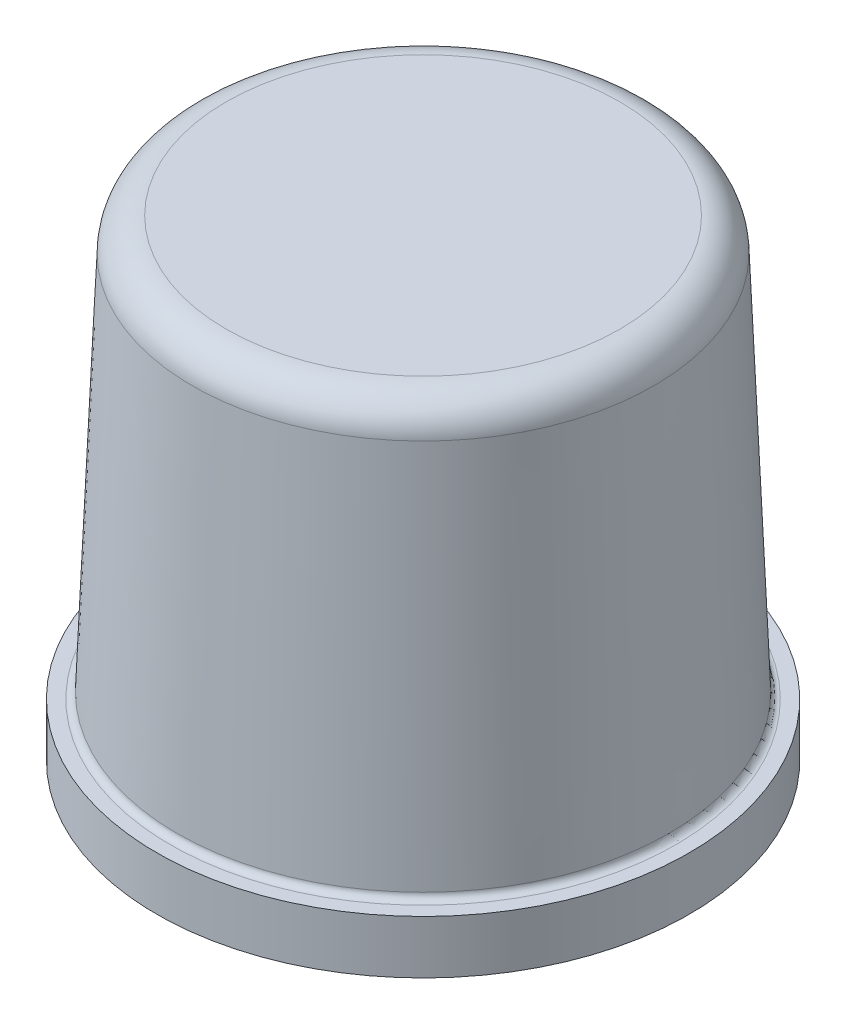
ISO-10303-21;
HEADER;
FILE_DESCRIPTION(('STEP AP214'),'2;1');
FILE_NAME('part.step','',(''),(''),'','','');
FILE_SCHEMA(('AUTOMOTIVE_DESIGN { 1 0 10303 214 1 1 1 1 }'));
ENDSEC;
DATA;
#1=APPLICATION_CONTEXT('core data for automotive mechanical design processes');
#2=APPLICATION_PROTOCOL_DEFINITION('international standard','automotive_design',2000,#1);
#3=PRODUCT_CONTEXT('',#1,'mechanical');
#4=PRODUCT('Part','Part','',(#3));
#5=PRODUCT_RELATED_PRODUCT_CATEGORY('part','',(#4));
#6=PRODUCT_DEFINITION_FORMATION('','',#4);
#7=PRODUCT_DEFINITION_CONTEXT('part definition',#1,'design');
#8=PRODUCT_DEFINITION('design','',#6,#7);
#9=PRODUCT_DEFINITION_SHAPE('','',#8);
#10=(LENGTH_UNIT() NAMED_UNIT(*) SI_UNIT(.MILLI.,.METRE.));
#11=(NAMED_UNIT(*) PLANE_ANGLE_UNIT() SI_UNIT($,.RADIAN.));
#12=(NAMED_UNIT(*) SI_UNIT($,.STERADIAN.) SOLID_ANGLE_UNIT());
#13=UNCERTAINTY_MEASURE_WITH_UNIT(LENGTH_MEASURE(1.E-05),#10,'distance_accuracy_value','');
#14=(GEOMETRIC_REPRESENTATION_CONTEXT(3) GLOBAL_UNCERTAINTY_ASSIGNED_CONTEXT((#13)) GLOBAL_UNIT_ASSIGNED_CONTEXT((#10,
#11,#12)) REPRESENTATION_CONTEXT('',''));
#15=CARTESIAN_POINT('',(0.,0.,0.));
#16=DIRECTION('',(0.,0.,1.));
#17=DIRECTION('',(1.,0.,0.));
#18=AXIS2_PLACEMENT_3D('',#15,#16,#17);
#19=CARTESIAN_POINT('',(0.,0.,0.));
#20=DIRECTION('',(0.,1.,0.));
#21=DIRECTION('',(0.,0.,1.));
#22=AXIS2_PLACEMENT_3D('',#19,#20,#21);
#23=PLANE('',#22);
#24=CARTESIAN_POINT('',(0.,0.,0.));
#25=DIRECTION('',(0.,-1.,0.));
#26=DIRECTION('',(0.,0.,-1.));
#27=AXIS2_PLACEMENT_3D('',#24,#25,#26);
#28=CIRCLE('',#27,39.5);
#29=CARTESIAN_POINT('',(0.,0.,-39.5));
#30=VERTEX_POINT('',#29);
#31=EDGE_CURVE('E10',#30,#30,#28,.T.);
#32=ORIENTED_EDGE('',*,*,#31,.T.);
#33=EDGE_LOOP('',(#32));
#34=FACE_BOUND('',#33,.T.);
#35=CARTESIAN_POINT('',(0.,0.,0.));
#36=DIRECTION('',(0.,1.,0.));
#37=DIRECTION('',(0.,0.,1.));
#38=AXIS2_PLACEMENT_3D('',#35,#36,#37);
#39=CIRCLE('',#38,37.5);
#40=CARTESIAN_POINT('',(0.,0.,37.5));
#41=VERTEX_POINT('',#40);
#42=EDGE_CURVE('E59',#41,#41,#39,.F.);
#43=ORIENTED_EDGE('',*,*,#42,.F.);
#44=EDGE_LOOP('',(#43));
#45=FACE_BOUND('',#44,.T.);
#46=ADVANCED_FACE('F34',(#34,#45),#23,.F.);
#47=CARTESIAN_POINT('',(0.,0.,0.));
#48=DIRECTION('',(0.,-1.,0.));
#49=DIRECTION('',(0.,0.,-1.));
#50=AXIS2_PLACEMENT_3D('',#47,#48,#49);
#51=CYLINDRICAL_SURFACE('',#50,39.5);
#52=ORIENTED_EDGE('',*,*,#31,.F.);
#53=EDGE_LOOP('',(#52));
#54=FACE_BOUND('',#53,.T.);
#55=CARTESIAN_POINT('',(0.,7.9,0.));
#56=DIRECTION('',(0.,-1.,0.));
#57=DIRECTION('',(0.,0.,-1.));
#58=AXIS2_PLACEMENT_3D('',#55,#56,#57);
#59=CIRCLE('',#58,39.5);
#60=CARTESIAN_POINT('',(0.,7.9,-39.5));
#61=VERTEX_POINT('',#60);
#62=EDGE_CURVE('E40',#61,#61,#59,.T.);
#63=ORIENTED_EDGE('',*,*,#62,.T.);
#64=EDGE_LOOP('',(#63));
#65=FACE_BOUND('',#64,.T.);
#66=ADVANCED_FACE('F96',(#54,#65),#51,.T.);
#67=CARTESIAN_POINT('',(-39.5,7.9,0.));
#68=DIRECTION('',(0.,-1.,0.));
#69=DIRECTION('',(0.,0.,-1.));
#70=AXIS2_PLACEMENT_3D('',#67,#68,#69);
#71=PLANE('',#70);
#72=ORIENTED_EDGE('',*,*,#62,.F.);
#73=EDGE_LOOP('',(#72));
#74=FACE_BOUND('',#73,.T.);
#75=CARTESIAN_POINT('',(0.,7.9,0.));
#76=DIRECTION('',(0.,-1.,0.));
#77=DIRECTION('',(0.,0.,-1.));
#78=AXIS2_PLACEMENT_3D('',#75,#76,#77);
#79=CIRCLE('',#78,37.4605523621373);
#80=CARTESIAN_POINT('',(0.,7.9,-37.4605523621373));
#81=VERTEX_POINT('',#80);
#82=EDGE_CURVE('E44',#81,#81,#79,.T.);
#83=ORIENTED_EDGE('',*,*,#82,.T.);
#84=EDGE_LOOP('',(#83));
#85=FACE_BOUND('',#84,.T.);
#86=ADVANCED_FACE('F100',(#74,#85),#71,.F.);
#87=CARTESIAN_POINT('',(0.,8.9,0.));
#88=DIRECTION('',(0.,-1.,0.));
#89=DIRECTION('',(0.,0.,-1.));
#90=AXIS2_PLACEMENT_3D('',#87,#88,#89);
#91=TOROIDAL_SURFACE('',#90,37.4605523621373,1.);
#92=ORIENTED_EDGE('',*,*,#82,.F.);
#93=EDGE_LOOP('',(#92));
#94=FACE_BOUND('',#93,.T.);
#95=CARTESIAN_POINT('',(0.,8.85977493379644,0.));
#96=DIRECTION('',(0.,-1.,0.));
#97=DIRECTION('',(0.,0.,-1.));
#98=AXIS2_PLACEMENT_3D('',#95,#96,#97);
#99=CIRCLE('',#98,36.461361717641);
#100=CARTESIAN_POINT('',(0.,8.85977493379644,-36.461361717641));
#101=VERTEX_POINT('',#100);
#102=EDGE_CURVE('E48',#101,#101,#99,.T.);
#103=ORIENTED_EDGE('',*,*,#102,.T.);
#104=EDGE_LOOP('',(#103));
#105=FACE_BOUND('',#104,.T.);
#106=ADVANCED_FACE('F107',(#94,#105),#91,.F.);
#107=CARTESIAN_POINT('',(0.,65.2011253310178,0.));
#108=DIRECTION('',(0.,-1.,0.));
#109=DIRECTION('',(0.,0.,-1.));
#110=AXIS2_PLACEMENT_3D('',#107,#108,#109);
#111=CONICAL_SURFACE('',#110,34.1931914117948,0.0402359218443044);
#112=ORIENTED_EDGE('',*,*,#102,.F.);
#113=EDGE_LOOP('',(#112));
#114=FACE_BOUND('',#113,.T.);
#115=CARTESIAN_POINT('',(0.,65.2011253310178,0.));
#116=DIRECTION('',(0.,-1.,0.));
#117=DIRECTION('',(0.,0.,-1.));
#118=AXIS2_PLACEMENT_3D('',#115,#116,#117);
#119=CIRCLE('',#118,34.1931914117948);
#120=CARTESIAN_POINT('',(0.,65.2011253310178,-34.1931914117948));
#121=VERTEX_POINT('',#120);
#122=EDGE_CURVE('E53',#121,#121,#119,.T.);
#123=ORIENTED_EDGE('',*,*,#122,.T.);
#124=EDGE_LOOP('',(#123));
#125=FACE_BOUND('',#124,.T.);
#126=ADVANCED_FACE('F113',(#114,#125),#111,.T.);
#127=CARTESIAN_POINT('',(0.,65.,0.));
#128=DIRECTION('',(0.,-1.,0.));
#129=DIRECTION('',(0.,0.,-1.));
#130=AXIS2_PLACEMENT_3D('',#127,#128,#129);
#131=TOROIDAL_SURFACE('',#130,29.1972381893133,5.);
#132=ORIENTED_EDGE('',*,*,#122,.F.);
#133=EDGE_LOOP('',(#132));
#134=FACE_BOUND('',#133,.T.);
#135=CARTESIAN_POINT('',(0.,70.,0.));
#136=DIRECTION('',(0.,-1.,0.));
#137=DIRECTION('',(0.,0.,-1.));
#138=AXIS2_PLACEMENT_3D('',#135,#136,#137);
#139=CIRCLE('',#138,29.1972381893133);
#140=CARTESIAN_POINT('',(0.,70.,-29.1972381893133));
#141=VERTEX_POINT('',#140);
#142=EDGE_CURVE('E56',#141,#141,#139,.T.);
#143=ORIENTED_EDGE('',*,*,#142,.T.);
#144=EDGE_LOOP('',(#143));
#145=FACE_BOUND('',#144,.T.);
#146=ADVANCED_FACE('F92',(#134,#145),#131,.T.);
#147=CARTESIAN_POINT('',(-29.1972381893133,70.,0.));
#148=DIRECTION('',(0.,-1.,0.));
#149=DIRECTION('',(0.,0.,-1.));
#150=AXIS2_PLACEMENT_3D('',#147,#148,#149);
#151=PLANE('',#150);
#152=ORIENTED_EDGE('',*,*,#142,.F.);
#153=EDGE_LOOP('',(#152));
#154=FACE_BOUND('',#153,.T.);
#155=ADVANCED_FACE('F83',(#154),#151,.F.);
#156=CARTESIAN_POINT('',(0.,0.,0.));
#157=DIRECTION('',(0.,-1.,0.));
#158=DIRECTION('',(0.,0.,-1.));
#159=AXIS2_PLACEMENT_3D('',#156,#157,#158);
#160=CYLINDRICAL_SURFACE('',#159,37.5);
#161=ORIENTED_EDGE('',*,*,#42,.T.);
#162=EDGE_LOOP('',(#161));
#163=FACE_BOUND('',#162,.T.);
#164=CARTESIAN_POINT('',(0.,5.9,0.));
#165=DIRECTION('',(0.,-1.,0.));
#166=DIRECTION('',(0.,0.,-1.));
#167=AXIS2_PLACEMENT_3D('',#164,#165,#166);
#168=CIRCLE('',#167,37.5);
#169=CARTESIAN_POINT('',(0.,5.9,-37.5));
#170=VERTEX_POINT('',#169);
#171=EDGE_CURVE('E62',#170,#170,#168,.T.);
#172=ORIENTED_EDGE('',*,*,#171,.F.);
#173=EDGE_LOOP('',(#172));
#174=FACE_BOUND('',#173,.T.);
#175=ADVANCED_FACE('F81',(#163,#174),#160,.F.);
#176=CARTESIAN_POINT('',(-39.5,5.9,0.));
#177=DIRECTION('',(0.,-1.,0.));
#178=DIRECTION('',(0.,0.,-1.));
#179=AXIS2_PLACEMENT_3D('',#176,#177,#178);
#180=PLANE('',#179);
#181=ORIENTED_EDGE('',*,*,#171,.T.);
#182=EDGE_LOOP('',(#181));
#183=FACE_BOUND('',#182,.T.);
#184=CARTESIAN_POINT('',(0.,5.89999999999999,0.));
#185=DIRECTION('',(0.,-1.,0.));
#186=DIRECTION('',(0.,0.,-1.));
#187=AXIS2_PLACEMENT_3D('',#184,#185,#186);
#188=CIRCLE('',#187,37.4605523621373);
#189=CARTESIAN_POINT('',(0.,5.89999999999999,-37.4605523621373));
#190=VERTEX_POINT('',#189);
#191=EDGE_CURVE('E72',#190,#190,#188,.T.);
#192=ORIENTED_EDGE('',*,*,#191,.F.);
#193=EDGE_LOOP('',(#192));
#194=FACE_BOUND('',#193,.T.);
#195=ADVANCED_FACE('F78',(#183,#194),#180,.T.);
#196=CARTESIAN_POINT('',(0.,8.9,0.));
#197=DIRECTION('',(0.,-1.,0.));
#198=DIRECTION('',(0.,0.,-1.));
#199=AXIS2_PLACEMENT_3D('',#196,#197,#198);
#200=TOROIDAL_SURFACE('',#199,37.4605523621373,3.);
#201=ORIENTED_EDGE('',*,*,#191,.T.);
#202=EDGE_LOOP('',(#201));
#203=FACE_BOUND('',#202,.T.);
#204=CARTESIAN_POINT('',(0.,8.77932480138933,0.));
#205=DIRECTION('',(0.,-1.,0.));
#206=DIRECTION('',(0.,0.,-1.));
#207=AXIS2_PLACEMENT_3D('',#204,#205,#206);
#208=CIRCLE('',#207,34.4629804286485);
#209=CARTESIAN_POINT('',(0.,8.77932480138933,-34.4629804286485));
#210=VERTEX_POINT('',#209);
#211=EDGE_CURVE('E69',#210,#210,#208,.T.);
#212=ORIENTED_EDGE('',*,*,#211,.F.);
#213=EDGE_LOOP('',(#212));
#214=FACE_BOUND('',#213,.T.);
#215=ADVANCED_FACE('F90',(#203,#214),#200,.T.);
#216=CARTESIAN_POINT('',(0.,65.1206751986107,0.));
#217=DIRECTION('',(0.,-1.,0.));
#218=DIRECTION('',(0.,0.,-1.));
#219=AXIS2_PLACEMENT_3D('',#216,#217,#218);
#220=CONICAL_SURFACE('',#219,32.1948101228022,0.0402359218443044);
#221=ORIENTED_EDGE('',*,*,#211,.T.);
#222=EDGE_LOOP('',(#221));
#223=FACE_BOUND('',#222,.T.);
#224=CARTESIAN_POINT('',(0.,65.1206751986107,0.));
#225=DIRECTION('',(0.,-1.,0.));
#226=DIRECTION('',(0.,0.,-1.));
#227=AXIS2_PLACEMENT_3D('',#224,#225,#226);
#228=CIRCLE('',#227,32.1948101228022);
#229=CARTESIAN_POINT('',(0.,65.1206751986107,-32.1948101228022));
#230=VERTEX_POINT('',#229);
#231=EDGE_CURVE('E66',#230,#230,#228,.T.);
#232=ORIENTED_EDGE('',*,*,#231,.F.);
#233=EDGE_LOOP('',(#232));
#234=FACE_BOUND('',#233,.T.);
#235=ADVANCED_FACE('F128',(#223,#234),#220,.F.);
#236=CARTESIAN_POINT('',(0.,65.,0.));
#237=DIRECTION('',(0.,-1.,0.));
#238=DIRECTION('',(0.,0.,-1.));
#239=AXIS2_PLACEMENT_3D('',#236,#237,#238);
#240=TOROIDAL_SURFACE('',#239,29.1972381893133,3.);
#241=ORIENTED_EDGE('',*,*,#231,.T.);
#242=EDGE_LOOP('',(#241));
#243=FACE_BOUND('',#242,.T.);
#244=CARTESIAN_POINT('',(0.,68.,0.));
#245=DIRECTION('',(0.,-1.,0.));
#246=DIRECTION('',(0.,0.,-1.));
#247=AXIS2_PLACEMENT_3D('',#244,#245,#246);
#248=CIRCLE('',#247,29.1972381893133);
#249=CARTESIAN_POINT('',(0.,68.,-29.1972381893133));
#250=VERTEX_POINT('',#249);
#251=EDGE_CURVE('E63',#250,#250,#248,.T.);
#252=ORIENTED_EDGE('',*,*,#251,.F.);
#253=EDGE_LOOP('',(#252));
#254=FACE_BOUND('',#253,.T.);
#255=ADVANCED_FACE('F124',(#243,#254),#240,.F.);
#256=CARTESIAN_POINT('',(-29.1972381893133,68.,0.));
#257=DIRECTION('',(0.,-1.,0.));
#258=DIRECTION('',(0.,0.,-1.));
#259=AXIS2_PLACEMENT_3D('',#256,#257,#258);
#260=PLANE('',#259);
#261=ORIENTED_EDGE('',*,*,#251,.T.);
#262=EDGE_LOOP('',(#261));
#263=FACE_BOUND('',#262,.T.);
#264=ADVANCED_FACE('F121',(#263),#260,.T.);
#265=CLOSED_SHELL('',(#46,#66,#86,#106,#126,#146,#155,#175,#195,#215,#235,#255,#264));
#266=MANIFOLD_SOLID_BREP('B2',#265);
#267=ADVANCED_BREP_SHAPE_REPRESENTATION('',(#18,#266),#14);
#268=SHAPE_DEFINITION_REPRESENTATION(#9,#267);
ENDSEC;
END-ISO-10303-21;
